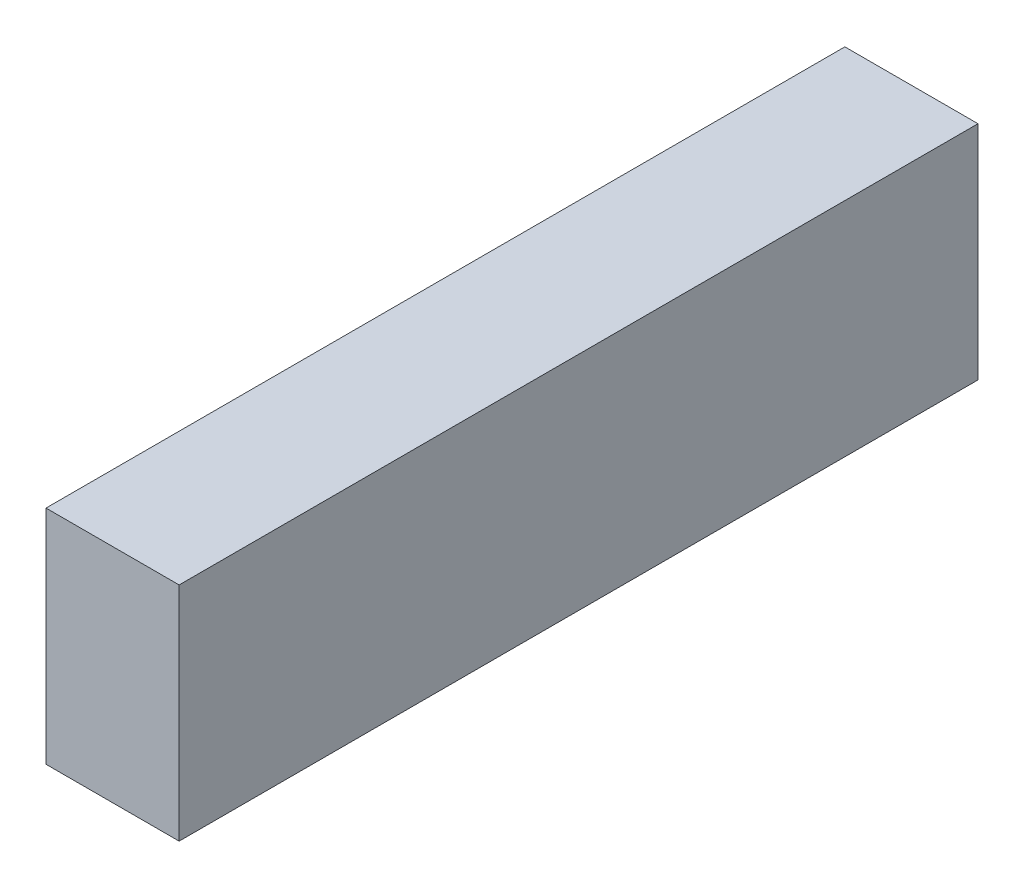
from build123d import *

# Parameters (mm, degrees)
ESQUISSE1_W      = 90
ESQUISSE1_H      = 25
EXTRUSION1_DEPTH = 15


with BuildPart() as part:
    # Esquisse1 → Extrusion1 (new body)
    with BuildSketch(Plane(origin=(0, 0, 0), x_dir=(0, 0, -1), z_dir=(1, 0, 0))):
        with Locations((49.826669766, 16.775050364)):
            Rectangle(ESQUISSE1_W, ESQUISSE1_H)
    extrude(amount=EXTRUSION1_DEPTH)


solid = part.part
